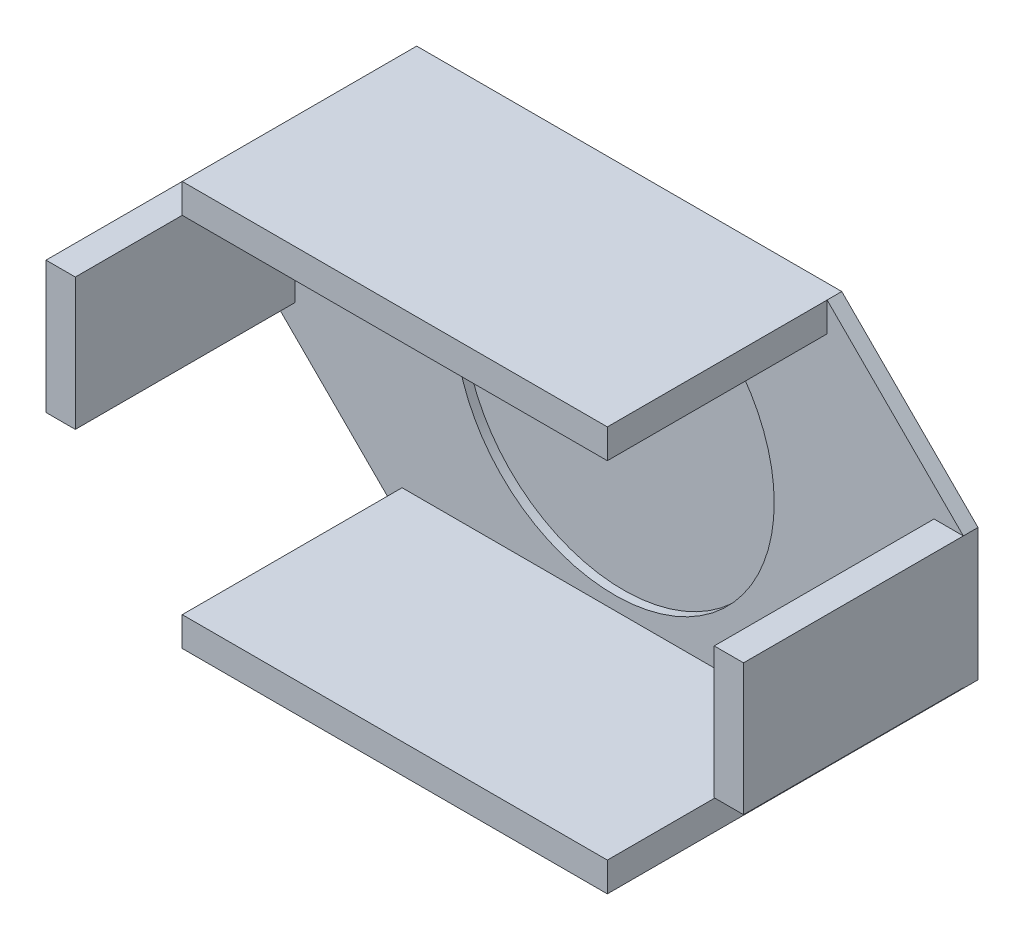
ISO-10303-21;
HEADER;
FILE_DESCRIPTION(('STEP AP214'),'2;1');
FILE_NAME('part.step','',(''),(''),'','','');
FILE_SCHEMA(('AUTOMOTIVE_DESIGN { 1 0 10303 214 1 1 1 1 }'));
ENDSEC;
DATA;
#1=APPLICATION_CONTEXT('core data for automotive mechanical design processes');
#2=APPLICATION_PROTOCOL_DEFINITION('international standard','automotive_design',2000,#1);
#3=PRODUCT_CONTEXT('',#1,'mechanical');
#4=PRODUCT('Part','Part','',(#3));
#5=PRODUCT_RELATED_PRODUCT_CATEGORY('part','',(#4));
#6=PRODUCT_DEFINITION_FORMATION('','',#4);
#7=PRODUCT_DEFINITION_CONTEXT('part definition',#1,'design');
#8=PRODUCT_DEFINITION('design','',#6,#7);
#9=PRODUCT_DEFINITION_SHAPE('','',#8);
#10=(LENGTH_UNIT() NAMED_UNIT(*) SI_UNIT(.MILLI.,.METRE.));
#11=(NAMED_UNIT(*) PLANE_ANGLE_UNIT() SI_UNIT($,.RADIAN.));
#12=(NAMED_UNIT(*) SI_UNIT($,.STERADIAN.) SOLID_ANGLE_UNIT());
#13=UNCERTAINTY_MEASURE_WITH_UNIT(LENGTH_MEASURE(1.E-05),#10,'distance_accuracy_value','');
#14=(GEOMETRIC_REPRESENTATION_CONTEXT(3) GLOBAL_UNCERTAINTY_ASSIGNED_CONTEXT((#13)) GLOBAL_UNIT_ASSIGNED_CONTEXT((#10,
#11,#12)) REPRESENTATION_CONTEXT('',''));
#15=CARTESIAN_POINT('',(0.,0.,0.));
#16=DIRECTION('',(0.,0.,1.));
#17=DIRECTION('',(1.,0.,0.));
#18=AXIS2_PLACEMENT_3D('',#15,#16,#17);
#19=CARTESIAN_POINT('',(0.,0.,61.));
#20=DIRECTION('',(0.,0.,1.));
#21=DIRECTION('',(1.,0.,0.));
#22=AXIS2_PLACEMENT_3D('',#19,#20,#21);
#23=PLANE('',#22);
#24=CARTESIAN_POINT('',(0.,0.,61.));
#25=DIRECTION('',(0.,0.,1.));
#26=DIRECTION('',(1.,0.,0.));
#27=AXIS2_PLACEMENT_3D('',#24,#25,#26);
#28=CIRCLE('',#27,10.8937097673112);
#29=CARTESIAN_POINT('',(10.8937097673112,0.,61.));
#30=VERTEX_POINT('',#29);
#31=EDGE_CURVE('E392',#30,#30,#28,.T.);
#32=ORIENTED_EDGE('',*,*,#31,.F.);
#33=EDGE_LOOP('',(#32));
#34=FACE_BOUND('',#33,.T.);
#35=DIRECTION('',(0.,1.,0.));
#36=VECTOR('',#35,1.);
#37=CARTESIAN_POINT('',(-21.8,-4.50294372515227,61.));
#38=LINE('',#37,#36);
#39=CARTESIAN_POINT('',(-21.8,-4.50294372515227,61.));
#40=VERTEX_POINT('',#39);
#41=CARTESIAN_POINT('',(-21.8,4.50294372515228,61.));
#42=VERTEX_POINT('',#41);
#43=EDGE_CURVE('E196',#40,#42,#38,.T.);
#44=ORIENTED_EDGE('',*,*,#43,.F.);
#45=DIRECTION('',(1.,0.,0.));
#46=VECTOR('',#45,1.);
#47=CARTESIAN_POINT('',(-23.8,-4.50294372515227,61.));
#48=LINE('',#47,#46);
#49=CARTESIAN_POINT('',(-23.8,-4.50294372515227,61.));
#50=VERTEX_POINT('',#49);
#51=EDGE_CURVE('E206',#50,#40,#48,.T.);
#52=ORIENTED_EDGE('',*,*,#51,.F.);
#53=DIRECTION('',(0.707106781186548,-0.707106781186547,0.));
#54=VECTOR('',#53,1.);
#55=CARTESIAN_POINT('',(-14.1514718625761,-14.1514718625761,61.));
#56=LINE('',#55,#54);
#57=CARTESIAN_POINT('',(-14.5029437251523,-13.8,61.));
#58=VERTEX_POINT('',#57);
#59=EDGE_CURVE('E320',#50,#58,#56,.T.);
#60=ORIENTED_EDGE('',*,*,#59,.T.);
#61=DIRECTION('',(0.,-1.,0.));
#62=VECTOR('',#61,1.);
#63=CARTESIAN_POINT('',(-14.5029437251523,-13.8,61.));
#64=LINE('',#63,#62);
#65=CARTESIAN_POINT('',(-14.5029437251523,-11.8,61.));
#66=VERTEX_POINT('',#65);
#67=EDGE_CURVE('E253',#66,#58,#64,.T.);
#68=ORIENTED_EDGE('',*,*,#67,.F.);
#69=DIRECTION('',(-1.,0.,0.));
#70=VECTOR('',#69,1.);
#71=CARTESIAN_POINT('',(-14.5029437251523,-11.8,61.));
#72=LINE('',#71,#70);
#73=CARTESIAN_POINT('',(14.506619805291,-11.8,61.));
#74=VERTEX_POINT('',#73);
#75=EDGE_CURVE('E244',#74,#66,#72,.T.);
#76=ORIENTED_EDGE('',*,*,#75,.F.);
#77=DIRECTION('',(0.,1.,0.));
#78=VECTOR('',#77,1.);
#79=CARTESIAN_POINT('',(14.506619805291,-13.8,61.));
#80=LINE('',#79,#78);
#81=CARTESIAN_POINT('',(14.506619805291,-13.7963239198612,61.));
#82=VERTEX_POINT('',#81);
#83=EDGE_CURVE('E246',#82,#74,#80,.T.);
#84=ORIENTED_EDGE('',*,*,#83,.F.);
#85=DIRECTION('',(-0.707106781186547,-0.707106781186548,0.));
#86=VECTOR('',#85,1.);
#87=CARTESIAN_POINT('',(14.1514718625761,-14.1514718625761,61.));
#88=LINE('',#87,#86);
#89=CARTESIAN_POINT('',(23.8,-4.50294372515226,61.));
#90=VERTEX_POINT('',#89);
#91=EDGE_CURVE('E325',#90,#82,#88,.T.);
#92=ORIENTED_EDGE('',*,*,#91,.F.);
#93=DIRECTION('',(0.,-1.,0.));
#94=VECTOR('',#93,1.);
#95=CARTESIAN_POINT('',(23.8,0.,61.));
#96=LINE('',#95,#94);
#97=CARTESIAN_POINT('',(23.8,-4.46911409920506,61.));
#98=VERTEX_POINT('',#97);
#99=EDGE_CURVE('E328',#98,#90,#96,.T.);
#100=ORIENTED_EDGE('',*,*,#99,.F.);
#101=DIRECTION('',(1.,0.,0.));
#102=VECTOR('',#101,1.);
#103=CARTESIAN_POINT('',(23.8,-4.46911409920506,61.));
#104=LINE('',#103,#102);
#105=CARTESIAN_POINT('',(21.8,-4.46911409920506,61.));
#106=VERTEX_POINT('',#105);
#107=EDGE_CURVE('E273',#106,#98,#104,.T.);
#108=ORIENTED_EDGE('',*,*,#107,.F.);
#109=DIRECTION('',(0.,-1.,0.));
#110=VECTOR('',#109,1.);
#111=CARTESIAN_POINT('',(21.8,4.50294372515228,61.));
#112=LINE('',#111,#110);
#113=CARTESIAN_POINT('',(21.8,4.50294372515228,61.));
#114=VERTEX_POINT('',#113);
#115=EDGE_CURVE('E275',#114,#106,#112,.T.);
#116=ORIENTED_EDGE('',*,*,#115,.F.);
#117=DIRECTION('',(-1.,0.,0.));
#118=VECTOR('',#117,1.);
#119=CARTESIAN_POINT('',(23.8,4.50294372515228,61.));
#120=LINE('',#119,#118);
#121=CARTESIAN_POINT('',(23.8,4.50294372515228,61.));
#122=VERTEX_POINT('',#121);
#123=EDGE_CURVE('E278',#122,#114,#120,.T.);
#124=ORIENTED_EDGE('',*,*,#123,.F.);
#125=DIRECTION('',(0.707106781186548,-0.707106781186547,0.));
#126=VECTOR('',#125,1.);
#127=CARTESIAN_POINT('',(14.1514718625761,14.1514718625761,61.));
#128=LINE('',#127,#126);
#129=CARTESIAN_POINT('',(14.506619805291,13.7963239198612,61.));
#130=VERTEX_POINT('',#129);
#131=EDGE_CURVE('E330',#130,#122,#128,.T.);
#132=ORIENTED_EDGE('',*,*,#131,.F.);
#133=DIRECTION('',(0.,1.,0.));
#134=VECTOR('',#133,1.);
#135=CARTESIAN_POINT('',(14.506619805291,13.8,61.));
#136=LINE('',#135,#134);
#137=CARTESIAN_POINT('',(14.506619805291,11.8,61.));
#138=VERTEX_POINT('',#137);
#139=EDGE_CURVE('E303',#138,#130,#136,.T.);
#140=ORIENTED_EDGE('',*,*,#139,.F.);
#141=DIRECTION('',(1.,0.,0.));
#142=VECTOR('',#141,1.);
#143=CARTESIAN_POINT('',(-14.5029437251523,11.8,61.));
#144=LINE('',#143,#142);
#145=CARTESIAN_POINT('',(-14.5029437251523,11.8,61.));
#146=VERTEX_POINT('',#145);
#147=EDGE_CURVE('E66',#146,#138,#144,.T.);
#148=ORIENTED_EDGE('',*,*,#147,.F.);
#149=DIRECTION('',(0.,-1.,0.));
#150=VECTOR('',#149,1.);
#151=CARTESIAN_POINT('',(-14.5029437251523,13.8,61.));
#152=LINE('',#151,#150);
#153=CARTESIAN_POINT('',(-14.5029437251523,13.8,61.));
#154=VERTEX_POINT('',#153);
#155=EDGE_CURVE('E280',#154,#146,#152,.T.);
#156=ORIENTED_EDGE('',*,*,#155,.F.);
#157=DIRECTION('',(0.707106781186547,0.707106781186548,0.));
#158=VECTOR('',#157,1.);
#159=CARTESIAN_POINT('',(-14.1514718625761,14.1514718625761,61.));
#160=LINE('',#159,#158);
#161=CARTESIAN_POINT('',(-23.8,4.50294372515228,61.));
#162=VERTEX_POINT('',#161);
#163=EDGE_CURVE('E219',#162,#154,#160,.T.);
#164=ORIENTED_EDGE('',*,*,#163,.F.);
#165=DIRECTION('',(-1.,0.,0.));
#166=VECTOR('',#165,1.);
#167=CARTESIAN_POINT('',(-23.8,4.50294372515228,61.));
#168=LINE('',#167,#166);
#169=EDGE_CURVE('E207',#42,#162,#168,.T.);
#170=ORIENTED_EDGE('',*,*,#169,.F.);
#171=EDGE_LOOP('',(#44,#52,#60,#68,#76,#84,#92,#100,#108,#116,#124,#132,#140,#148,#156,#164,#170));
#172=FACE_BOUND('',#171,.T.);
#173=ADVANCED_FACE('F43',(#34,#172),#23,.T.);
#174=CARTESIAN_POINT('',(0.,13.8,61.));
#175=DIRECTION('',(0.,1.,0.));
#176=DIRECTION('',(0.,0.,1.));
#177=AXIS2_PLACEMENT_3D('',#174,#175,#176);
#178=PLANE('',#177);
#179=DIRECTION('',(1.,0.,0.));
#180=VECTOR('',#179,1.);
#181=CARTESIAN_POINT('',(0.,13.8,60.));
#182=LINE('',#181,#180);
#183=CARTESIAN_POINT('',(-14.5029437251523,13.8,60.));
#184=VERTEX_POINT('',#183);
#185=CARTESIAN_POINT('',(14.5029437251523,13.8,60.));
#186=VERTEX_POINT('',#185);
#187=EDGE_CURVE('E318',#184,#186,#182,.T.);
#188=ORIENTED_EDGE('',*,*,#187,.F.);
#189=DIRECTION('',(0.,0.,-1.));
#190=VECTOR('',#189,1.);
#191=CARTESIAN_POINT('',(-14.5029437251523,13.8,61.));
#192=LINE('',#191,#190);
#193=EDGE_CURVE('E11',#154,#184,#192,.T.);
#194=ORIENTED_EDGE('',*,*,#193,.F.);
#195=DIRECTION('',(0.,0.,-1.));
#196=VECTOR('',#195,1.);
#197=CARTESIAN_POINT('',(-14.5029437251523,13.8,76.));
#198=LINE('',#197,#196);
#199=CARTESIAN_POINT('',(-14.5029437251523,13.8,76.));
#200=VERTEX_POINT('',#199);
#201=EDGE_CURVE('E298',#200,#154,#198,.T.);
#202=ORIENTED_EDGE('',*,*,#201,.F.);
#203=DIRECTION('',(-1.,0.,0.));
#204=VECTOR('',#203,1.);
#205=CARTESIAN_POINT('',(-14.5029437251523,13.8,76.));
#206=LINE('',#205,#204);
#207=CARTESIAN_POINT('',(14.506619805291,13.8,76.));
#208=VERTEX_POINT('',#207);
#209=EDGE_CURVE('E296',#208,#200,#206,.T.);
#210=ORIENTED_EDGE('',*,*,#209,.F.);
#211=DIRECTION('',(0.,0.,-1.));
#212=VECTOR('',#211,1.);
#213=CARTESIAN_POINT('',(14.506619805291,13.8,76.));
#214=LINE('',#213,#212);
#215=CARTESIAN_POINT('',(14.506619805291,13.8,61.));
#216=VERTEX_POINT('',#215);
#217=EDGE_CURVE('E310',#208,#216,#214,.T.);
#218=ORIENTED_EDGE('',*,*,#217,.T.);
#219=DIRECTION('',(-1.,0.,0.));
#220=VECTOR('',#219,1.);
#221=CARTESIAN_POINT('',(-14.5029437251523,13.8,61.));
#222=LINE('',#221,#220);
#223=CARTESIAN_POINT('',(14.5029437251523,13.8,61.));
#224=VERTEX_POINT('',#223);
#225=EDGE_CURVE('E292',#216,#224,#222,.T.);
#226=ORIENTED_EDGE('',*,*,#225,.T.);
#227=DIRECTION('',(0.,0.,-1.));
#228=VECTOR('',#227,1.);
#229=CARTESIAN_POINT('',(14.5029437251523,13.8,61.));
#230=LINE('',#229,#228);
#231=EDGE_CURVE('E334',#224,#186,#230,.T.);
#232=ORIENTED_EDGE('',*,*,#231,.T.);
#233=EDGE_LOOP('',(#188,#194,#202,#210,#218,#226,#232));
#234=FACE_BOUND('',#233,.T.);
#235=ADVANCED_FACE('F45',(#234),#178,.T.);
#236=CARTESIAN_POINT('',(-14.1514718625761,14.1514718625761,61.));
#237=DIRECTION('',(-0.707106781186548,0.707106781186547,0.));
#238=DIRECTION('',(-0.707106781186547,-0.707106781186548,0.));
#239=AXIS2_PLACEMENT_3D('',#236,#237,#238);
#240=PLANE('',#239);
#241=DIRECTION('',(0.707106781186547,0.707106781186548,0.));
#242=VECTOR('',#241,1.);
#243=CARTESIAN_POINT('',(-14.1514718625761,14.1514718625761,60.));
#244=LINE('',#243,#242);
#245=CARTESIAN_POINT('',(-23.8,4.50294372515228,60.));
#246=VERTEX_POINT('',#245);
#247=EDGE_CURVE('E337',#246,#184,#244,.T.);
#248=ORIENTED_EDGE('',*,*,#247,.F.);
#249=DIRECTION('',(0.,0.,-1.));
#250=VECTOR('',#249,1.);
#251=CARTESIAN_POINT('',(-23.8,4.50294372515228,61.));
#252=LINE('',#251,#250);
#253=EDGE_CURVE('E51',#162,#246,#252,.T.);
#254=ORIENTED_EDGE('',*,*,#253,.F.);
#255=ORIENTED_EDGE('',*,*,#163,.T.);
#256=ORIENTED_EDGE('',*,*,#193,.T.);
#257=EDGE_LOOP('',(#248,#254,#255,#256));
#258=FACE_BOUND('',#257,.T.);
#259=ADVANCED_FACE('F374',(#258),#240,.T.);
#260=CARTESIAN_POINT('',(-23.8,0.,61.));
#261=DIRECTION('',(-1.,0.,0.));
#262=DIRECTION('',(0.,0.,1.));
#263=AXIS2_PLACEMENT_3D('',#260,#261,#262);
#264=PLANE('',#263);
#265=DIRECTION('',(0.,1.,0.));
#266=VECTOR('',#265,1.);
#267=CARTESIAN_POINT('',(-23.8,0.,60.));
#268=LINE('',#267,#266);
#269=CARTESIAN_POINT('',(-23.8,-4.50294372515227,60.));
#270=VERTEX_POINT('',#269);
#271=EDGE_CURVE('E340',#270,#246,#268,.T.);
#272=ORIENTED_EDGE('',*,*,#271,.F.);
#273=DIRECTION('',(0.,0.,-1.));
#274=VECTOR('',#273,1.);
#275=CARTESIAN_POINT('',(-23.8,-4.50294372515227,61.));
#276=LINE('',#275,#274);
#277=EDGE_CURVE('E366',#50,#270,#276,.T.);
#278=ORIENTED_EDGE('',*,*,#277,.F.);
#279=DIRECTION('',(0.,0.,-1.));
#280=VECTOR('',#279,1.);
#281=CARTESIAN_POINT('',(-23.8,-4.50294372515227,76.));
#282=LINE('',#281,#280);
#283=CARTESIAN_POINT('',(-23.8,-4.50294372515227,76.));
#284=VERTEX_POINT('',#283);
#285=EDGE_CURVE('E386',#284,#50,#282,.T.);
#286=ORIENTED_EDGE('',*,*,#285,.F.);
#287=DIRECTION('',(0.,-1.,0.));
#288=VECTOR('',#287,1.);
#289=CARTESIAN_POINT('',(-23.8,-4.50294372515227,76.));
#290=LINE('',#289,#288);
#291=CARTESIAN_POINT('',(-23.8,4.50294372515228,76.));
#292=VERTEX_POINT('',#291);
#293=EDGE_CURVE('E220',#292,#284,#290,.T.);
#294=ORIENTED_EDGE('',*,*,#293,.F.);
#295=DIRECTION('',(0.,0.,-1.));
#296=VECTOR('',#295,1.);
#297=CARTESIAN_POINT('',(-23.8,4.50294372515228,76.));
#298=LINE('',#297,#296);
#299=EDGE_CURVE('E215',#292,#162,#298,.T.);
#300=ORIENTED_EDGE('',*,*,#299,.T.);
#301=ORIENTED_EDGE('',*,*,#253,.T.);
#302=EDGE_LOOP('',(#272,#278,#286,#294,#300,#301));
#303=FACE_BOUND('',#302,.T.);
#304=ADVANCED_FACE('F370',(#303),#264,.T.);
#305=CARTESIAN_POINT('',(-14.1514718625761,-14.1514718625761,61.));
#306=DIRECTION('',(0.707106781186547,0.707106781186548,0.));
#307=DIRECTION('',(-0.707106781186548,0.707106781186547,0.));
#308=AXIS2_PLACEMENT_3D('',#305,#306,#307);
#309=PLANE('',#308);
#310=DIRECTION('',(0.707106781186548,-0.707106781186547,0.));
#311=VECTOR('',#310,1.);
#312=CARTESIAN_POINT('',(-14.1514718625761,-14.1514718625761,60.));
#313=LINE('',#312,#311);
#314=CARTESIAN_POINT('',(-14.5029437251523,-13.8,60.));
#315=VERTEX_POINT('',#314);
#316=EDGE_CURVE('E343',#270,#315,#313,.T.);
#317=ORIENTED_EDGE('',*,*,#316,.T.);
#318=DIRECTION('',(0.,0.,-1.));
#319=VECTOR('',#318,1.);
#320=CARTESIAN_POINT('',(-14.5029437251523,-13.8,61.));
#321=LINE('',#320,#319);
#322=EDGE_CURVE('E364',#58,#315,#321,.T.);
#323=ORIENTED_EDGE('',*,*,#322,.F.);
#324=ORIENTED_EDGE('',*,*,#59,.F.);
#325=ORIENTED_EDGE('',*,*,#277,.T.);
#326=EDGE_LOOP('',(#317,#323,#324,#325));
#327=FACE_BOUND('',#326,.T.);
#328=ADVANCED_FACE('F383',(#327),#309,.F.);
#329=CARTESIAN_POINT('',(0.,-13.8,61.));
#330=DIRECTION('',(0.,-1.,0.));
#331=DIRECTION('',(1.,0.,0.));
#332=AXIS2_PLACEMENT_3D('',#329,#330,#331);
#333=PLANE('',#332);
#334=DIRECTION('',(-1.,0.,0.));
#335=VECTOR('',#334,1.);
#336=CARTESIAN_POINT('',(0.,-13.8,60.));
#337=LINE('',#336,#335);
#338=CARTESIAN_POINT('',(14.5029437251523,-13.8,60.));
#339=VERTEX_POINT('',#338);
#340=EDGE_CURVE('E346',#339,#315,#337,.T.);
#341=ORIENTED_EDGE('',*,*,#340,.F.);
#342=DIRECTION('',(0.,0.,-1.));
#343=VECTOR('',#342,1.);
#344=CARTESIAN_POINT('',(14.5029437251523,-13.8,61.));
#345=LINE('',#344,#343);
#346=CARTESIAN_POINT('',(14.5029437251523,-13.8,61.));
#347=VERTEX_POINT('',#346);
#348=EDGE_CURVE('E362',#347,#339,#345,.T.);
#349=ORIENTED_EDGE('',*,*,#348,.F.);
#350=DIRECTION('',(1.,0.,0.));
#351=VECTOR('',#350,1.);
#352=CARTESIAN_POINT('',(-14.5029437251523,-13.8,61.));
#353=LINE('',#352,#351);
#354=CARTESIAN_POINT('',(14.506619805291,-13.8,61.));
#355=VERTEX_POINT('',#354);
#356=EDGE_CURVE('E251',#347,#355,#353,.T.);
#357=ORIENTED_EDGE('',*,*,#356,.T.);
#358=DIRECTION('',(0.,0.,-1.));
#359=VECTOR('',#358,1.);
#360=CARTESIAN_POINT('',(14.506619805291,-13.8,76.));
#361=LINE('',#360,#359);
#362=CARTESIAN_POINT('',(14.506619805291,-13.8,76.));
#363=VERTEX_POINT('',#362);
#364=EDGE_CURVE('E234',#363,#355,#361,.T.);
#365=ORIENTED_EDGE('',*,*,#364,.F.);
#366=DIRECTION('',(1.,0.,0.));
#367=VECTOR('',#366,1.);
#368=CARTESIAN_POINT('',(-14.5029437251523,-13.8,76.));
#369=LINE('',#368,#367);
#370=CARTESIAN_POINT('',(-14.5029437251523,-13.8,76.));
#371=VERTEX_POINT('',#370);
#372=EDGE_CURVE('E260',#371,#363,#369,.T.);
#373=ORIENTED_EDGE('',*,*,#372,.F.);
#374=DIRECTION('',(0.,0.,-1.));
#375=VECTOR('',#374,1.);
#376=CARTESIAN_POINT('',(-14.5029437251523,-13.8,76.));
#377=LINE('',#376,#375);
#378=EDGE_CURVE('E228',#371,#58,#377,.T.);
#379=ORIENTED_EDGE('',*,*,#378,.T.);
#380=ORIENTED_EDGE('',*,*,#322,.T.);
#381=EDGE_LOOP('',(#341,#349,#357,#365,#373,#379,#380));
#382=FACE_BOUND('',#381,.T.);
#383=ADVANCED_FACE('F423',(#382),#333,.T.);
#384=CARTESIAN_POINT('',(14.1514718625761,-14.1514718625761,61.));
#385=DIRECTION('',(0.707106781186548,-0.707106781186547,0.));
#386=DIRECTION('',(0.707106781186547,0.707106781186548,0.));
#387=AXIS2_PLACEMENT_3D('',#384,#385,#386);
#388=PLANE('',#387);
#389=DIRECTION('',(-0.707106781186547,-0.707106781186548,0.));
#390=VECTOR('',#389,1.);
#391=CARTESIAN_POINT('',(14.1514718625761,-14.1514718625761,60.));
#392=LINE('',#391,#390);
#393=CARTESIAN_POINT('',(23.8,-4.50294372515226,60.));
#394=VERTEX_POINT('',#393);
#395=EDGE_CURVE('E349',#394,#339,#392,.T.);
#396=ORIENTED_EDGE('',*,*,#395,.F.);
#397=DIRECTION('',(0.,0.,-1.));
#398=VECTOR('',#397,1.);
#399=CARTESIAN_POINT('',(23.8,-4.50294372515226,61.));
#400=LINE('',#399,#398);
#401=EDGE_CURVE('E360',#90,#394,#400,.T.);
#402=ORIENTED_EDGE('',*,*,#401,.F.);
#403=ORIENTED_EDGE('',*,*,#91,.T.);
#404=EDGE_CURVE('E324',#82,#347,#88,.T.);
#405=ORIENTED_EDGE('',*,*,#404,.T.);
#406=ORIENTED_EDGE('',*,*,#348,.T.);
#407=EDGE_LOOP('',(#396,#402,#403,#405,#406));
#408=FACE_BOUND('',#407,.T.);
#409=ADVANCED_FACE('F419',(#408),#388,.T.);
#410=CARTESIAN_POINT('',(23.8,0.,61.));
#411=DIRECTION('',(1.,0.,0.));
#412=DIRECTION('',(0.,1.,0.));
#413=AXIS2_PLACEMENT_3D('',#410,#411,#412);
#414=PLANE('',#413);
#415=DIRECTION('',(0.,-1.,0.));
#416=VECTOR('',#415,1.);
#417=CARTESIAN_POINT('',(23.8,0.,60.));
#418=LINE('',#417,#416);
#419=CARTESIAN_POINT('',(23.8,4.50294372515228,60.));
#420=VERTEX_POINT('',#419);
#421=EDGE_CURVE('E352',#420,#394,#418,.T.);
#422=ORIENTED_EDGE('',*,*,#421,.F.);
#423=DIRECTION('',(0.,0.,-1.));
#424=VECTOR('',#423,1.);
#425=CARTESIAN_POINT('',(23.8,4.50294372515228,61.));
#426=LINE('',#425,#424);
#427=EDGE_CURVE('E358',#122,#420,#426,.T.);
#428=ORIENTED_EDGE('',*,*,#427,.F.);
#429=DIRECTION('',(0.,0.,-1.));
#430=VECTOR('',#429,1.);
#431=CARTESIAN_POINT('',(23.8,4.50294372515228,76.));
#432=LINE('',#431,#430);
#433=CARTESIAN_POINT('',(23.8,4.50294372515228,76.));
#434=VERTEX_POINT('',#433);
#435=EDGE_CURVE('E256',#434,#122,#432,.T.);
#436=ORIENTED_EDGE('',*,*,#435,.F.);
#437=DIRECTION('',(0.,1.,0.));
#438=VECTOR('',#437,1.);
#439=CARTESIAN_POINT('',(23.8,4.50294372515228,76.));
#440=LINE('',#439,#438);
#441=CARTESIAN_POINT('',(23.8,-4.46911409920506,76.));
#442=VERTEX_POINT('',#441);
#443=EDGE_CURVE('E276',#442,#434,#440,.T.);
#444=ORIENTED_EDGE('',*,*,#443,.F.);
#445=DIRECTION('',(0.,0.,-1.));
#446=VECTOR('',#445,1.);
#447=CARTESIAN_POINT('',(23.8,-4.46911409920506,76.));
#448=LINE('',#447,#446);
#449=EDGE_CURVE('E269',#442,#98,#448,.T.);
#450=ORIENTED_EDGE('',*,*,#449,.T.);
#451=ORIENTED_EDGE('',*,*,#99,.T.);
#452=ORIENTED_EDGE('',*,*,#401,.T.);
#453=EDGE_LOOP('',(#422,#428,#436,#444,#450,#451,#452));
#454=FACE_BOUND('',#453,.T.);
#455=ADVANCED_FACE('F415',(#454),#414,.T.);
#456=CARTESIAN_POINT('',(14.1514718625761,14.1514718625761,61.));
#457=DIRECTION('',(0.707106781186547,0.707106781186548,0.));
#458=DIRECTION('',(-0.707106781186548,0.707106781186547,0.));
#459=AXIS2_PLACEMENT_3D('',#456,#457,#458);
#460=PLANE('',#459);
#461=DIRECTION('',(0.707106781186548,-0.707106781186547,0.));
#462=VECTOR('',#461,1.);
#463=CARTESIAN_POINT('',(14.1514718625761,14.1514718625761,60.));
#464=LINE('',#463,#462);
#465=EDGE_CURVE('E321',#186,#420,#464,.T.);
#466=ORIENTED_EDGE('',*,*,#465,.F.);
#467=ORIENTED_EDGE('',*,*,#231,.F.);
#468=EDGE_CURVE('E331',#224,#130,#128,.T.);
#469=ORIENTED_EDGE('',*,*,#468,.T.);
#470=ORIENTED_EDGE('',*,*,#131,.T.);
#471=ORIENTED_EDGE('',*,*,#427,.T.);
#472=EDGE_LOOP('',(#466,#467,#469,#470,#471));
#473=FACE_BOUND('',#472,.T.);
#474=ADVANCED_FACE('F412',(#473),#460,.T.);
#475=CARTESIAN_POINT('',(0.,0.,60.));
#476=DIRECTION('',(0.,0.,1.));
#477=DIRECTION('',(1.,0.,0.));
#478=AXIS2_PLACEMENT_3D('',#475,#476,#477);
#479=PLANE('',#478);
#480=ORIENTED_EDGE('',*,*,#187,.T.);
#481=ORIENTED_EDGE('',*,*,#465,.T.);
#482=ORIENTED_EDGE('',*,*,#421,.T.);
#483=ORIENTED_EDGE('',*,*,#395,.T.);
#484=ORIENTED_EDGE('',*,*,#340,.T.);
#485=ORIENTED_EDGE('',*,*,#316,.F.);
#486=ORIENTED_EDGE('',*,*,#271,.T.);
#487=ORIENTED_EDGE('',*,*,#247,.T.);
#488=EDGE_LOOP('',(#480,#481,#482,#483,#484,#485,#486,#487));
#489=FACE_BOUND('',#488,.T.);
#490=ADVANCED_FACE('F379',(#489),#479,.F.);
#491=CARTESIAN_POINT('',(-14.5029437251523,13.8,76.));
#492=DIRECTION('',(1.,0.,0.));
#493=DIRECTION('',(0.,0.,-1.));
#494=AXIS2_PLACEMENT_3D('',#491,#492,#493);
#495=PLANE('',#494);
#496=ORIENTED_EDGE('',*,*,#155,.T.);
#497=DIRECTION('',(0.,0.,-1.));
#498=VECTOR('',#497,1.);
#499=CARTESIAN_POINT('',(-14.5029437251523,11.8,76.));
#500=LINE('',#499,#498);
#501=CARTESIAN_POINT('',(-14.5029437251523,11.8,76.));
#502=VERTEX_POINT('',#501);
#503=EDGE_CURVE('E316',#502,#146,#500,.T.);
#504=ORIENTED_EDGE('',*,*,#503,.F.);
#505=DIRECTION('',(0.,-1.,0.));
#506=VECTOR('',#505,1.);
#507=CARTESIAN_POINT('',(-14.5029437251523,13.8,76.));
#508=LINE('',#507,#506);
#509=EDGE_CURVE('E288',#200,#502,#508,.T.);
#510=ORIENTED_EDGE('',*,*,#509,.F.);
#511=ORIENTED_EDGE('',*,*,#201,.T.);
#512=EDGE_LOOP('',(#496,#504,#510,#511));
#513=FACE_BOUND('',#512,.T.);
#514=ADVANCED_FACE('F408',(#513),#495,.F.);
#515=CARTESIAN_POINT('',(-14.5029437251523,11.8,76.));
#516=DIRECTION('',(0.,1.,0.));
#517=DIRECTION('',(0.,0.,1.));
#518=AXIS2_PLACEMENT_3D('',#515,#516,#517);
#519=PLANE('',#518);
#520=ORIENTED_EDGE('',*,*,#147,.T.);
#521=DIRECTION('',(0.,0.,-1.));
#522=VECTOR('',#521,1.);
#523=CARTESIAN_POINT('',(14.506619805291,11.8,76.));
#524=LINE('',#523,#522);
#525=CARTESIAN_POINT('',(14.506619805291,11.8,76.));
#526=VERTEX_POINT('',#525);
#527=EDGE_CURVE('E313',#526,#138,#524,.T.);
#528=ORIENTED_EDGE('',*,*,#527,.F.);
#529=DIRECTION('',(1.,0.,0.));
#530=VECTOR('',#529,1.);
#531=CARTESIAN_POINT('',(-14.5029437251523,11.8,76.));
#532=LINE('',#531,#530);
#533=EDGE_CURVE('E291',#502,#526,#532,.T.);
#534=ORIENTED_EDGE('',*,*,#533,.F.);
#535=ORIENTED_EDGE('',*,*,#503,.T.);
#536=EDGE_LOOP('',(#520,#528,#534,#535));
#537=FACE_BOUND('',#536,.T.);
#538=ADVANCED_FACE('F470',(#537),#519,.F.);
#539=CARTESIAN_POINT('',(14.506619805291,13.8,76.));
#540=DIRECTION('',(-1.,0.,0.));
#541=DIRECTION('',(0.,0.,1.));
#542=AXIS2_PLACEMENT_3D('',#539,#540,#541);
#543=PLANE('',#542);
#544=ORIENTED_EDGE('',*,*,#139,.T.);
#545=EDGE_CURVE('E302',#130,#216,#136,.T.);
#546=ORIENTED_EDGE('',*,*,#545,.T.);
#547=ORIENTED_EDGE('',*,*,#217,.F.);
#548=DIRECTION('',(0.,1.,0.));
#549=VECTOR('',#548,1.);
#550=CARTESIAN_POINT('',(14.506619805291,13.8,76.));
#551=LINE('',#550,#549);
#552=EDGE_CURVE('E294',#526,#208,#551,.T.);
#553=ORIENTED_EDGE('',*,*,#552,.F.);
#554=ORIENTED_EDGE('',*,*,#527,.T.);
#555=EDGE_LOOP('',(#544,#546,#547,#553,#554));
#556=FACE_BOUND('',#555,.T.);
#557=ADVANCED_FACE('F477',(#556),#543,.F.);
#558=CARTESIAN_POINT('',(0.,0.,76.));
#559=DIRECTION('',(0.,0.,1.));
#560=DIRECTION('',(1.,0.,0.));
#561=AXIS2_PLACEMENT_3D('',#558,#559,#560);
#562=PLANE('',#561);
#563=ORIENTED_EDGE('',*,*,#509,.T.);
#564=ORIENTED_EDGE('',*,*,#533,.T.);
#565=ORIENTED_EDGE('',*,*,#552,.T.);
#566=ORIENTED_EDGE('',*,*,#209,.T.);
#567=EDGE_LOOP('',(#563,#564,#565,#566));
#568=FACE_BOUND('',#567,.T.);
#569=ADVANCED_FACE('F484',(#568),#562,.T.);
#570=CARTESIAN_POINT('',(0.,0.,61.));
#571=DIRECTION('',(0.,0.,1.));
#572=DIRECTION('',(1.,0.,0.));
#573=AXIS2_PLACEMENT_3D('',#570,#571,#572);
#574=PLANE('',#573);
#575=ORIENTED_EDGE('',*,*,#468,.F.);
#576=ORIENTED_EDGE('',*,*,#225,.F.);
#577=ORIENTED_EDGE('',*,*,#545,.F.);
#578=EDGE_LOOP('',(#575,#576,#577));
#579=FACE_BOUND('',#578,.T.);
#580=ADVANCED_FACE('F492',(#579),#574,.F.);
#581=CARTESIAN_POINT('',(23.8,4.50294372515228,76.));
#582=DIRECTION('',(0.,-1.,0.));
#583=DIRECTION('',(0.,0.,-1.));
#584=AXIS2_PLACEMENT_3D('',#581,#582,#583);
#585=PLANE('',#584);
#586=ORIENTED_EDGE('',*,*,#123,.T.);
#587=DIRECTION('',(0.,0.,-1.));
#588=VECTOR('',#587,1.);
#589=CARTESIAN_POINT('',(21.8,4.50294372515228,76.));
#590=LINE('',#589,#588);
#591=CARTESIAN_POINT('',(21.8,4.50294372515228,76.));
#592=VERTEX_POINT('',#591);
#593=EDGE_CURVE('E265',#592,#114,#590,.T.);
#594=ORIENTED_EDGE('',*,*,#593,.F.);
#595=DIRECTION('',(-1.,0.,0.));
#596=VECTOR('',#595,1.);
#597=CARTESIAN_POINT('',(23.8,4.50294372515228,76.));
#598=LINE('',#597,#596);
#599=EDGE_CURVE('E284',#434,#592,#598,.T.);
#600=ORIENTED_EDGE('',*,*,#599,.F.);
#601=ORIENTED_EDGE('',*,*,#435,.T.);
#602=EDGE_LOOP('',(#586,#594,#600,#601));
#603=FACE_BOUND('',#602,.T.);
#604=ADVANCED_FACE('F500',(#603),#585,.F.);
#605=CARTESIAN_POINT('',(21.8,4.50294372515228,76.));
#606=DIRECTION('',(1.,0.,0.));
#607=DIRECTION('',(0.,0.,-1.));
#608=AXIS2_PLACEMENT_3D('',#605,#606,#607);
#609=PLANE('',#608);
#610=ORIENTED_EDGE('',*,*,#115,.T.);
#611=DIRECTION('',(0.,0.,-1.));
#612=VECTOR('',#611,1.);
#613=CARTESIAN_POINT('',(21.8,-4.46911409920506,76.));
#614=LINE('',#613,#612);
#615=CARTESIAN_POINT('',(21.8,-4.46911409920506,76.));
#616=VERTEX_POINT('',#615);
#617=EDGE_CURVE('E58',#616,#106,#614,.T.);
#618=ORIENTED_EDGE('',*,*,#617,.F.);
#619=DIRECTION('',(0.,-1.,0.));
#620=VECTOR('',#619,1.);
#621=CARTESIAN_POINT('',(21.8,4.50294372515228,76.));
#622=LINE('',#621,#620);
#623=EDGE_CURVE('E282',#592,#616,#622,.T.);
#624=ORIENTED_EDGE('',*,*,#623,.F.);
#625=ORIENTED_EDGE('',*,*,#593,.T.);
#626=EDGE_LOOP('',(#610,#618,#624,#625));
#627=FACE_BOUND('',#626,.T.);
#628=ADVANCED_FACE('F508',(#627),#609,.F.);
#629=CARTESIAN_POINT('',(23.8,-4.46911409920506,76.));
#630=DIRECTION('',(0.,1.,0.));
#631=DIRECTION('',(0.,0.,1.));
#632=AXIS2_PLACEMENT_3D('',#629,#630,#631);
#633=PLANE('',#632);
#634=ORIENTED_EDGE('',*,*,#107,.T.);
#635=ORIENTED_EDGE('',*,*,#449,.F.);
#636=DIRECTION('',(1.,0.,0.));
#637=VECTOR('',#636,1.);
#638=CARTESIAN_POINT('',(23.8,-4.46911409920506,76.));
#639=LINE('',#638,#637);
#640=EDGE_CURVE('E272',#616,#442,#639,.T.);
#641=ORIENTED_EDGE('',*,*,#640,.F.);
#642=ORIENTED_EDGE('',*,*,#617,.T.);
#643=EDGE_LOOP('',(#634,#635,#641,#642));
#644=FACE_BOUND('',#643,.T.);
#645=ADVANCED_FACE('F516',(#644),#633,.F.);
#646=CARTESIAN_POINT('',(0.,0.,76.));
#647=DIRECTION('',(0.,0.,-1.));
#648=DIRECTION('',(-1.,0.,0.));
#649=AXIS2_PLACEMENT_3D('',#646,#647,#648);
#650=PLANE('',#649);
#651=ORIENTED_EDGE('',*,*,#443,.T.);
#652=ORIENTED_EDGE('',*,*,#599,.T.);
#653=ORIENTED_EDGE('',*,*,#623,.T.);
#654=ORIENTED_EDGE('',*,*,#640,.T.);
#655=EDGE_LOOP('',(#651,#652,#653,#654));
#656=FACE_BOUND('',#655,.T.);
#657=ADVANCED_FACE('F524',(#656),#650,.F.);
#658=CARTESIAN_POINT('',(-14.5029437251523,-13.8,76.));
#659=DIRECTION('',(1.,0.,0.));
#660=DIRECTION('',(0.,0.,-1.));
#661=AXIS2_PLACEMENT_3D('',#658,#659,#660);
#662=PLANE('',#661);
#663=ORIENTED_EDGE('',*,*,#67,.T.);
#664=ORIENTED_EDGE('',*,*,#378,.F.);
#665=DIRECTION('',(0.,-1.,0.));
#666=VECTOR('',#665,1.);
#667=CARTESIAN_POINT('',(-14.5029437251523,-13.8,76.));
#668=LINE('',#667,#666);
#669=CARTESIAN_POINT('',(-14.5029437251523,-11.8,76.));
#670=VERTEX_POINT('',#669);
#671=EDGE_CURVE('E247',#670,#371,#668,.T.);
#672=ORIENTED_EDGE('',*,*,#671,.F.);
#673=DIRECTION('',(0.,0.,-1.));
#674=VECTOR('',#673,1.);
#675=CARTESIAN_POINT('',(-14.5029437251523,-11.8,76.));
#676=LINE('',#675,#674);
#677=EDGE_CURVE('E240',#670,#66,#676,.T.);
#678=ORIENTED_EDGE('',*,*,#677,.T.);
#679=EDGE_LOOP('',(#663,#664,#672,#678));
#680=FACE_BOUND('',#679,.T.);
#681=ADVANCED_FACE('F531',(#680),#662,.F.);
#682=CARTESIAN_POINT('',(14.506619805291,-13.8,76.));
#683=DIRECTION('',(-1.,0.,0.));
#684=DIRECTION('',(0.,0.,1.));
#685=AXIS2_PLACEMENT_3D('',#682,#683,#684);
#686=PLANE('',#685);
#687=EDGE_CURVE('E248',#355,#82,#80,.T.);
#688=ORIENTED_EDGE('',*,*,#687,.T.);
#689=ORIENTED_EDGE('',*,*,#83,.T.);
#690=DIRECTION('',(0.,0.,-1.));
#691=VECTOR('',#690,1.);
#692=CARTESIAN_POINT('',(14.506619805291,-11.8,76.));
#693=LINE('',#692,#691);
#694=CARTESIAN_POINT('',(14.506619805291,-11.8,76.));
#695=VERTEX_POINT('',#694);
#696=EDGE_CURVE('E237',#695,#74,#693,.T.);
#697=ORIENTED_EDGE('',*,*,#696,.F.);
#698=DIRECTION('',(0.,1.,0.));
#699=VECTOR('',#698,1.);
#700=CARTESIAN_POINT('',(14.506619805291,-13.8,76.));
#701=LINE('',#700,#699);
#702=EDGE_CURVE('E258',#363,#695,#701,.T.);
#703=ORIENTED_EDGE('',*,*,#702,.F.);
#704=ORIENTED_EDGE('',*,*,#364,.T.);
#705=EDGE_LOOP('',(#688,#689,#697,#703,#704));
#706=FACE_BOUND('',#705,.T.);
#707=ADVANCED_FACE('F539',(#706),#686,.F.);
#708=CARTESIAN_POINT('',(-14.5029437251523,-11.8,76.));
#709=DIRECTION('',(0.,-1.,0.));
#710=DIRECTION('',(0.,0.,-1.));
#711=AXIS2_PLACEMENT_3D('',#708,#709,#710);
#712=PLANE('',#711);
#713=ORIENTED_EDGE('',*,*,#75,.T.);
#714=ORIENTED_EDGE('',*,*,#677,.F.);
#715=DIRECTION('',(-1.,0.,0.));
#716=VECTOR('',#715,1.);
#717=CARTESIAN_POINT('',(-14.5029437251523,-11.8,76.));
#718=LINE('',#717,#716);
#719=EDGE_CURVE('E243',#695,#670,#718,.T.);
#720=ORIENTED_EDGE('',*,*,#719,.F.);
#721=ORIENTED_EDGE('',*,*,#696,.T.);
#722=EDGE_LOOP('',(#713,#714,#720,#721));
#723=FACE_BOUND('',#722,.T.);
#724=ADVANCED_FACE('F547',(#723),#712,.F.);
#725=CARTESIAN_POINT('',(0.,0.,76.));
#726=DIRECTION('',(0.,0.,-1.));
#727=DIRECTION('',(-1.,0.,0.));
#728=AXIS2_PLACEMENT_3D('',#725,#726,#727);
#729=PLANE('',#728);
#730=ORIENTED_EDGE('',*,*,#671,.T.);
#731=ORIENTED_EDGE('',*,*,#372,.T.);
#732=ORIENTED_EDGE('',*,*,#702,.T.);
#733=ORIENTED_EDGE('',*,*,#719,.T.);
#734=EDGE_LOOP('',(#730,#731,#732,#733));
#735=FACE_BOUND('',#734,.T.);
#736=ADVANCED_FACE('F555',(#735),#729,.F.);
#737=CARTESIAN_POINT('',(0.,0.,61.));
#738=DIRECTION('',(0.,0.,-1.));
#739=DIRECTION('',(-1.,0.,0.));
#740=AXIS2_PLACEMENT_3D('',#737,#738,#739);
#741=PLANE('',#740);
#742=ORIENTED_EDGE('',*,*,#356,.F.);
#743=ORIENTED_EDGE('',*,*,#404,.F.);
#744=ORIENTED_EDGE('',*,*,#687,.F.);
#745=EDGE_LOOP('',(#742,#743,#744));
#746=FACE_BOUND('',#745,.T.);
#747=ADVANCED_FACE('F563',(#746),#741,.T.);
#748=CARTESIAN_POINT('',(-23.8,-4.50294372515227,76.));
#749=DIRECTION('',(0.,1.,0.));
#750=DIRECTION('',(0.,0.,1.));
#751=AXIS2_PLACEMENT_3D('',#748,#749,#750);
#752=PLANE('',#751);
#753=ORIENTED_EDGE('',*,*,#51,.T.);
#754=DIRECTION('',(0.,0.,-1.));
#755=VECTOR('',#754,1.);
#756=CARTESIAN_POINT('',(-21.8,-4.50294372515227,76.));
#757=LINE('',#756,#755);
#758=CARTESIAN_POINT('',(-21.8,-4.50294372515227,76.));
#759=VERTEX_POINT('',#758);
#760=EDGE_CURVE('E203',#759,#40,#757,.T.);
#761=ORIENTED_EDGE('',*,*,#760,.F.);
#762=DIRECTION('',(1.,0.,0.));
#763=VECTOR('',#762,1.);
#764=CARTESIAN_POINT('',(-23.8,-4.50294372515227,76.));
#765=LINE('',#764,#763);
#766=EDGE_CURVE('E223',#284,#759,#765,.T.);
#767=ORIENTED_EDGE('',*,*,#766,.F.);
#768=ORIENTED_EDGE('',*,*,#285,.T.);
#769=EDGE_LOOP('',(#753,#761,#767,#768));
#770=FACE_BOUND('',#769,.T.);
#771=ADVANCED_FACE('F571',(#770),#752,.F.);
#772=CARTESIAN_POINT('',(-21.8,-4.50294372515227,76.));
#773=DIRECTION('',(-1.,0.,0.));
#774=DIRECTION('',(0.,0.,1.));
#775=AXIS2_PLACEMENT_3D('',#772,#773,#774);
#776=PLANE('',#775);
#777=ORIENTED_EDGE('',*,*,#43,.T.);
#778=DIRECTION('',(0.,0.,-1.));
#779=VECTOR('',#778,1.);
#780=CARTESIAN_POINT('',(-21.8,4.50294372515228,76.));
#781=LINE('',#780,#779);
#782=CARTESIAN_POINT('',(-21.8,4.50294372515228,76.));
#783=VERTEX_POINT('',#782);
#784=EDGE_CURVE('E200',#783,#42,#781,.T.);
#785=ORIENTED_EDGE('',*,*,#784,.F.);
#786=DIRECTION('',(0.,1.,0.));
#787=VECTOR('',#786,1.);
#788=CARTESIAN_POINT('',(-21.8,-4.50294372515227,76.));
#789=LINE('',#788,#787);
#790=EDGE_CURVE('E230',#759,#783,#789,.T.);
#791=ORIENTED_EDGE('',*,*,#790,.F.);
#792=ORIENTED_EDGE('',*,*,#760,.T.);
#793=EDGE_LOOP('',(#777,#785,#791,#792));
#794=FACE_BOUND('',#793,.T.);
#795=ADVANCED_FACE('F198',(#794),#776,.F.);
#796=CARTESIAN_POINT('',(-23.8,4.50294372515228,76.));
#797=DIRECTION('',(0.,-1.,0.));
#798=DIRECTION('',(0.,0.,-1.));
#799=AXIS2_PLACEMENT_3D('',#796,#797,#798);
#800=PLANE('',#799);
#801=ORIENTED_EDGE('',*,*,#169,.T.);
#802=ORIENTED_EDGE('',*,*,#299,.F.);
#803=DIRECTION('',(-1.,0.,0.));
#804=VECTOR('',#803,1.);
#805=CARTESIAN_POINT('',(-23.8,4.50294372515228,76.));
#806=LINE('',#805,#804);
#807=EDGE_CURVE('E214',#783,#292,#806,.T.);
#808=ORIENTED_EDGE('',*,*,#807,.F.);
#809=ORIENTED_EDGE('',*,*,#784,.T.);
#810=EDGE_LOOP('',(#801,#802,#808,#809));
#811=FACE_BOUND('',#810,.T.);
#812=ADVANCED_FACE('F211',(#811),#800,.F.);
#813=CARTESIAN_POINT('',(0.,0.,76.));
#814=DIRECTION('',(0.,0.,-1.));
#815=DIRECTION('',(-1.,0.,0.));
#816=AXIS2_PLACEMENT_3D('',#813,#814,#815);
#817=PLANE('',#816);
#818=ORIENTED_EDGE('',*,*,#293,.T.);
#819=ORIENTED_EDGE('',*,*,#766,.T.);
#820=ORIENTED_EDGE('',*,*,#790,.T.);
#821=ORIENTED_EDGE('',*,*,#807,.T.);
#822=EDGE_LOOP('',(#818,#819,#820,#821));
#823=FACE_BOUND('',#822,.T.);
#824=ADVANCED_FACE('F591',(#823),#817,.F.);
#825=CARTESIAN_POINT('',(0.,0.,60.4));
#826=DIRECTION('',(0.,0.,1.));
#827=DIRECTION('',(1.,0.,0.));
#828=AXIS2_PLACEMENT_3D('',#825,#826,#827);
#829=CYLINDRICAL_SURFACE('',#828,10.8937097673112);
#830=CARTESIAN_POINT('',(0.,0.,60.4));
#831=DIRECTION('',(0.,0.,1.));
#832=DIRECTION('',(1.,0.,0.));
#833=AXIS2_PLACEMENT_3D('',#830,#831,#832);
#834=CIRCLE('',#833,10.8937097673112);
#835=CARTESIAN_POINT('',(10.8937097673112,0.,60.4));
#836=VERTEX_POINT('',#835);
#837=EDGE_CURVE('E388',#836,#836,#834,.T.);
#838=ORIENTED_EDGE('',*,*,#837,.F.);
#839=EDGE_LOOP('',(#838));
#840=FACE_BOUND('',#839,.T.);
#841=ORIENTED_EDGE('',*,*,#31,.T.);
#842=EDGE_LOOP('',(#841));
#843=FACE_BOUND('',#842,.T.);
#844=ADVANCED_FACE('F398',(#840,#843),#829,.F.);
#845=CARTESIAN_POINT('',(0.,0.,60.4));
#846=DIRECTION('',(0.,0.,1.));
#847=DIRECTION('',(1.,0.,0.));
#848=AXIS2_PLACEMENT_3D('',#845,#846,#847);
#849=PLANE('',#848);
#850=ORIENTED_EDGE('',*,*,#837,.T.);
#851=EDGE_LOOP('',(#850));
#852=FACE_BOUND('',#851,.T.);
#853=ADVANCED_FACE('F605',(#852),#849,.T.);
#854=CLOSED_SHELL('',(#173,#235,#259,#304,#328,#383,#409,#455,#474,#490,#514,#538,#557,#569,
#580,#604,#628,#645,#657,#681,#707,#724,#736,#747,#771,#795,#812,#824,#844,#853));
#855=MANIFOLD_SOLID_BREP('B2',#854);
#856=ADVANCED_BREP_SHAPE_REPRESENTATION('',(#18,#855),#14);
#857=SHAPE_DEFINITION_REPRESENTATION(#9,#856);
ENDSEC;
END-ISO-10303-21;
